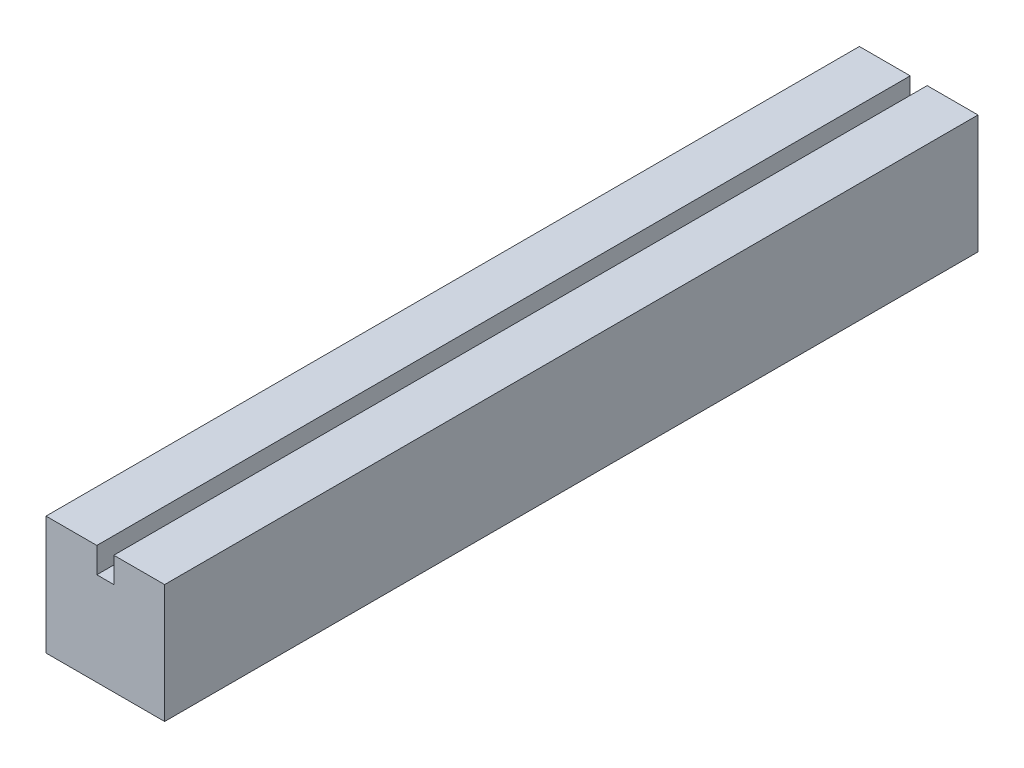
ISO-10303-21;
HEADER;
FILE_DESCRIPTION(('STEP AP214'),'2;1');
FILE_NAME('part.step','',(''),(''),'','','');
FILE_SCHEMA(('AUTOMOTIVE_DESIGN { 1 0 10303 214 1 1 1 1 }'));
ENDSEC;
DATA;
#1=APPLICATION_CONTEXT('core data for automotive mechanical design processes');
#2=APPLICATION_PROTOCOL_DEFINITION('international standard','automotive_design',2000,#1);
#3=PRODUCT_CONTEXT('',#1,'mechanical');
#4=PRODUCT('Part','Part','',(#3));
#5=PRODUCT_RELATED_PRODUCT_CATEGORY('part','',(#4));
#6=PRODUCT_DEFINITION_FORMATION('','',#4);
#7=PRODUCT_DEFINITION_CONTEXT('part definition',#1,'design');
#8=PRODUCT_DEFINITION('design','',#6,#7);
#9=PRODUCT_DEFINITION_SHAPE('','',#8);
#10=(LENGTH_UNIT() NAMED_UNIT(*) SI_UNIT(.MILLI.,.METRE.));
#11=(NAMED_UNIT(*) PLANE_ANGLE_UNIT() SI_UNIT($,.RADIAN.));
#12=(NAMED_UNIT(*) SI_UNIT($,.STERADIAN.) SOLID_ANGLE_UNIT());
#13=UNCERTAINTY_MEASURE_WITH_UNIT(LENGTH_MEASURE(1.E-05),#10,'distance_accuracy_value','');
#14=(GEOMETRIC_REPRESENTATION_CONTEXT(3) GLOBAL_UNCERTAINTY_ASSIGNED_CONTEXT((#13)) GLOBAL_UNIT_ASSIGNED_CONTEXT((#10,
#11,#12)) REPRESENTATION_CONTEXT('',''));
#15=CARTESIAN_POINT('',(0.,0.,0.));
#16=DIRECTION('',(0.,0.,1.));
#17=DIRECTION('',(1.,0.,0.));
#18=AXIS2_PLACEMENT_3D('',#15,#16,#17);
#19=CARTESIAN_POINT('',(0.,44.45,609.6));
#20=DIRECTION('',(0.,1.,0.));
#21=DIRECTION('',(0.,0.,1.));
#22=AXIS2_PLACEMENT_3D('',#19,#20,#21);
#23=PLANE('',#22);
#24=DIRECTION('',(1.,0.,0.));
#25=VECTOR('',#24,1.);
#26=CARTESIAN_POINT('',(0.,44.45,0.));
#27=LINE('',#26,#25);
#28=CARTESIAN_POINT('',(6.34999999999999,44.45,0.));
#29=VERTEX_POINT('',#28);
#30=CARTESIAN_POINT('',(44.45,44.45,0.));
#31=VERTEX_POINT('',#30);
#32=EDGE_CURVE('E139',#29,#31,#27,.T.);
#33=ORIENTED_EDGE('',*,*,#32,.F.);
#34=DIRECTION('',(0.,0.,-1.));
#35=VECTOR('',#34,1.);
#36=CARTESIAN_POINT('',(6.34999999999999,44.45,609.6));
#37=LINE('',#36,#35);
#38=CARTESIAN_POINT('',(6.34999999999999,44.45,609.6));
#39=VERTEX_POINT('',#38);
#40=EDGE_CURVE('E11',#39,#29,#37,.T.);
#41=ORIENTED_EDGE('',*,*,#40,.F.);
#42=DIRECTION('',(1.,0.,0.));
#43=VECTOR('',#42,1.);
#44=CARTESIAN_POINT('',(0.,44.45,609.6));
#45=LINE('',#44,#43);
#46=CARTESIAN_POINT('',(44.45,44.45,609.6));
#47=VERTEX_POINT('',#46);
#48=EDGE_CURVE('E164',#39,#47,#45,.T.);
#49=ORIENTED_EDGE('',*,*,#48,.T.);
#50=DIRECTION('',(0.,0.,-1.));
#51=VECTOR('',#50,1.);
#52=CARTESIAN_POINT('',(44.45,44.45,609.6));
#53=LINE('',#52,#51);
#54=EDGE_CURVE('E57',#47,#31,#53,.T.);
#55=ORIENTED_EDGE('',*,*,#54,.T.);
#56=EDGE_LOOP('',(#33,#41,#49,#55));
#57=FACE_BOUND('',#56,.T.);
#58=ADVANCED_FACE('F39',(#57),#23,.T.);
#59=CARTESIAN_POINT('',(6.35,0.,609.6));
#60=DIRECTION('',(1.,0.,0.));
#61=DIRECTION('',(0.,1.,0.));
#62=AXIS2_PLACEMENT_3D('',#59,#60,#61);
#63=PLANE('',#62);
#64=DIRECTION('',(0.,-1.,0.));
#65=VECTOR('',#64,1.);
#66=CARTESIAN_POINT('',(6.35,0.,0.));
#67=LINE('',#66,#65);
#68=CARTESIAN_POINT('',(6.34999999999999,25.4,0.));
#69=VERTEX_POINT('',#68);
#70=EDGE_CURVE('E142',#29,#69,#67,.T.);
#71=ORIENTED_EDGE('',*,*,#70,.T.);
#72=DIRECTION('',(0.,0.,-1.));
#73=VECTOR('',#72,1.);
#74=CARTESIAN_POINT('',(6.34999999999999,25.4,609.6));
#75=LINE('',#74,#73);
#76=CARTESIAN_POINT('',(6.34999999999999,25.4,609.6));
#77=VERTEX_POINT('',#76);
#78=EDGE_CURVE('E49',#77,#69,#75,.T.);
#79=ORIENTED_EDGE('',*,*,#78,.F.);
#80=DIRECTION('',(0.,-1.,0.));
#81=VECTOR('',#80,1.);
#82=CARTESIAN_POINT('',(6.35,0.,609.6));
#83=LINE('',#82,#81);
#84=EDGE_CURVE('E195',#39,#77,#83,.T.);
#85=ORIENTED_EDGE('',*,*,#84,.F.);
#86=ORIENTED_EDGE('',*,*,#40,.T.);
#87=EDGE_LOOP('',(#71,#79,#85,#86));
#88=FACE_BOUND('',#87,.T.);
#89=ADVANCED_FACE('F41',(#88),#63,.F.);
#90=CARTESIAN_POINT('',(0.,25.4,609.6));
#91=DIRECTION('',(0.,1.,0.));
#92=DIRECTION('',(0.,0.,1.));
#93=AXIS2_PLACEMENT_3D('',#90,#91,#92);
#94=PLANE('',#93);
#95=DIRECTION('',(1.,0.,0.));
#96=VECTOR('',#95,1.);
#97=CARTESIAN_POINT('',(0.,25.4,0.));
#98=LINE('',#97,#96);
#99=CARTESIAN_POINT('',(-6.35000000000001,25.4,0.));
#100=VERTEX_POINT('',#99);
#101=EDGE_CURVE('E147',#100,#69,#98,.T.);
#102=ORIENTED_EDGE('',*,*,#101,.F.);
#103=DIRECTION('',(0.,0.,-1.));
#104=VECTOR('',#103,1.);
#105=CARTESIAN_POINT('',(-6.35000000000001,25.4,609.6));
#106=LINE('',#105,#104);
#107=CARTESIAN_POINT('',(-6.35000000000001,25.4,609.6));
#108=VERTEX_POINT('',#107);
#109=EDGE_CURVE('E174',#108,#100,#106,.T.);
#110=ORIENTED_EDGE('',*,*,#109,.F.);
#111=DIRECTION('',(1.,0.,0.));
#112=VECTOR('',#111,1.);
#113=CARTESIAN_POINT('',(0.,25.4,609.6));
#114=LINE('',#113,#112);
#115=EDGE_CURVE('E183',#108,#77,#114,.T.);
#116=ORIENTED_EDGE('',*,*,#115,.T.);
#117=ORIENTED_EDGE('',*,*,#78,.T.);
#118=EDGE_LOOP('',(#102,#110,#116,#117));
#119=FACE_BOUND('',#118,.T.);
#120=ADVANCED_FACE('F181',(#119),#94,.T.);
#121=CARTESIAN_POINT('',(-6.35,0.,609.6));
#122=DIRECTION('',(1.,0.,0.));
#123=DIRECTION('',(0.,1.,0.));
#124=AXIS2_PLACEMENT_3D('',#121,#122,#123);
#125=PLANE('',#124);
#126=DIRECTION('',(0.,-1.,0.));
#127=VECTOR('',#126,1.);
#128=CARTESIAN_POINT('',(-6.35,0.,0.));
#129=LINE('',#128,#127);
#130=CARTESIAN_POINT('',(-6.35000000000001,44.45,0.));
#131=VERTEX_POINT('',#130);
#132=EDGE_CURVE('E151',#131,#100,#129,.T.);
#133=ORIENTED_EDGE('',*,*,#132,.F.);
#134=DIRECTION('',(0.,0.,-1.));
#135=VECTOR('',#134,1.);
#136=CARTESIAN_POINT('',(-6.35000000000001,44.45,609.6));
#137=LINE('',#136,#135);
#138=CARTESIAN_POINT('',(-6.35000000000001,44.45,609.6));
#139=VERTEX_POINT('',#138);
#140=EDGE_CURVE('E171',#139,#131,#137,.T.);
#141=ORIENTED_EDGE('',*,*,#140,.F.);
#142=DIRECTION('',(0.,-1.,0.));
#143=VECTOR('',#142,1.);
#144=CARTESIAN_POINT('',(-6.35,0.,609.6));
#145=LINE('',#144,#143);
#146=EDGE_CURVE('E194',#139,#108,#145,.T.);
#147=ORIENTED_EDGE('',*,*,#146,.T.);
#148=ORIENTED_EDGE('',*,*,#109,.T.);
#149=EDGE_LOOP('',(#133,#141,#147,#148));
#150=FACE_BOUND('',#149,.T.);
#151=ADVANCED_FACE('F192',(#150),#125,.T.);
#152=CARTESIAN_POINT('',(-44.45,44.45,0.));
#153=VERTEX_POINT('',#152);
#154=EDGE_CURVE('E143',#153,#131,#27,.T.);
#155=ORIENTED_EDGE('',*,*,#154,.F.);
#156=DIRECTION('',(0.,0.,-1.));
#157=VECTOR('',#156,1.);
#158=CARTESIAN_POINT('',(-44.45,44.45,609.6));
#159=LINE('',#158,#157);
#160=CARTESIAN_POINT('',(-44.45,44.45,609.6));
#161=VERTEX_POINT('',#160);
#162=EDGE_CURVE('E129',#161,#153,#159,.T.);
#163=ORIENTED_EDGE('',*,*,#162,.F.);
#164=EDGE_CURVE('E117',#161,#139,#45,.T.);
#165=ORIENTED_EDGE('',*,*,#164,.T.);
#166=ORIENTED_EDGE('',*,*,#140,.T.);
#167=EDGE_LOOP('',(#155,#163,#165,#166));
#168=FACE_BOUND('',#167,.T.);
#169=ADVANCED_FACE('F205',(#168),#23,.T.);
#170=CARTESIAN_POINT('',(-44.45,0.,609.6));
#171=DIRECTION('',(1.,0.,0.));
#172=DIRECTION('',(0.,1.,0.));
#173=AXIS2_PLACEMENT_3D('',#170,#171,#172);
#174=PLANE('',#173);
#175=DIRECTION('',(0.,-1.,0.));
#176=VECTOR('',#175,1.);
#177=CARTESIAN_POINT('',(-44.45,0.,0.));
#178=LINE('',#177,#176);
#179=CARTESIAN_POINT('',(-44.45,-44.45,0.));
#180=VERTEX_POINT('',#179);
#181=EDGE_CURVE('E125',#153,#180,#178,.T.);
#182=ORIENTED_EDGE('',*,*,#181,.T.);
#183=DIRECTION('',(0.,0.,-1.));
#184=VECTOR('',#183,1.);
#185=CARTESIAN_POINT('',(-44.45,-44.45,609.6));
#186=LINE('',#185,#184);
#187=CARTESIAN_POINT('',(-44.45,-44.45,609.6));
#188=VERTEX_POINT('',#187);
#189=EDGE_CURVE('E122',#188,#180,#186,.T.);
#190=ORIENTED_EDGE('',*,*,#189,.F.);
#191=DIRECTION('',(0.,-1.,0.));
#192=VECTOR('',#191,1.);
#193=CARTESIAN_POINT('',(-44.45,0.,609.6));
#194=LINE('',#193,#192);
#195=EDGE_CURVE('E108',#161,#188,#194,.T.);
#196=ORIENTED_EDGE('',*,*,#195,.F.);
#197=ORIENTED_EDGE('',*,*,#162,.T.);
#198=EDGE_LOOP('',(#182,#190,#196,#197));
#199=FACE_BOUND('',#198,.T.);
#200=ADVANCED_FACE('F123',(#199),#174,.F.);
#201=CARTESIAN_POINT('',(0.,-44.45,609.6));
#202=DIRECTION('',(0.,1.,0.));
#203=DIRECTION('',(0.,0.,1.));
#204=AXIS2_PLACEMENT_3D('',#201,#202,#203);
#205=PLANE('',#204);
#206=DIRECTION('',(1.,0.,0.));
#207=VECTOR('',#206,1.);
#208=CARTESIAN_POINT('',(0.,-44.45,0.));
#209=LINE('',#208,#207);
#210=CARTESIAN_POINT('',(44.45,-44.45,0.));
#211=VERTEX_POINT('',#210);
#212=EDGE_CURVE('E157',#180,#211,#209,.T.);
#213=ORIENTED_EDGE('',*,*,#212,.T.);
#214=DIRECTION('',(0.,0.,-1.));
#215=VECTOR('',#214,1.);
#216=CARTESIAN_POINT('',(44.45,-44.45,609.6));
#217=LINE('',#216,#215);
#218=CARTESIAN_POINT('',(44.45,-44.45,609.6));
#219=VERTEX_POINT('',#218);
#220=EDGE_CURVE('E83',#219,#211,#217,.T.);
#221=ORIENTED_EDGE('',*,*,#220,.F.);
#222=DIRECTION('',(1.,0.,0.));
#223=VECTOR('',#222,1.);
#224=CARTESIAN_POINT('',(0.,-44.45,609.6));
#225=LINE('',#224,#223);
#226=EDGE_CURVE('E114',#188,#219,#225,.T.);
#227=ORIENTED_EDGE('',*,*,#226,.F.);
#228=ORIENTED_EDGE('',*,*,#189,.T.);
#229=EDGE_LOOP('',(#213,#221,#227,#228));
#230=FACE_BOUND('',#229,.T.);
#231=ADVANCED_FACE('F131',(#230),#205,.F.);
#232=CARTESIAN_POINT('',(44.45,0.,609.6));
#233=DIRECTION('',(1.,0.,0.));
#234=DIRECTION('',(0.,1.,0.));
#235=AXIS2_PLACEMENT_3D('',#232,#233,#234);
#236=PLANE('',#235);
#237=DIRECTION('',(0.,-1.,0.));
#238=VECTOR('',#237,1.);
#239=CARTESIAN_POINT('',(44.45,0.,0.));
#240=LINE('',#239,#238);
#241=EDGE_CURVE('E160',#31,#211,#240,.T.);
#242=ORIENTED_EDGE('',*,*,#241,.F.);
#243=ORIENTED_EDGE('',*,*,#54,.F.);
#244=DIRECTION('',(0.,-1.,0.));
#245=VECTOR('',#244,1.);
#246=CARTESIAN_POINT('',(44.45,0.,609.6));
#247=LINE('',#246,#245);
#248=EDGE_CURVE('E133',#47,#219,#247,.T.);
#249=ORIENTED_EDGE('',*,*,#248,.T.);
#250=ORIENTED_EDGE('',*,*,#220,.T.);
#251=EDGE_LOOP('',(#242,#243,#249,#250));
#252=FACE_BOUND('',#251,.T.);
#253=ADVANCED_FACE('F206',(#252),#236,.T.);
#254=CARTESIAN_POINT('',(0.,0.,609.6));
#255=DIRECTION('',(0.,0.,1.));
#256=DIRECTION('',(1.,0.,0.));
#257=AXIS2_PLACEMENT_3D('',#254,#255,#256);
#258=PLANE('',#257);
#259=ORIENTED_EDGE('',*,*,#48,.F.);
#260=ORIENTED_EDGE('',*,*,#84,.T.);
#261=ORIENTED_EDGE('',*,*,#115,.F.);
#262=ORIENTED_EDGE('',*,*,#146,.F.);
#263=ORIENTED_EDGE('',*,*,#164,.F.);
#264=ORIENTED_EDGE('',*,*,#195,.T.);
#265=ORIENTED_EDGE('',*,*,#226,.T.);
#266=ORIENTED_EDGE('',*,*,#248,.F.);
#267=EDGE_LOOP('',(#259,#260,#261,#262,#263,#264,#265,#266));
#268=FACE_BOUND('',#267,.T.);
#269=ADVANCED_FACE('F111',(#268),#258,.T.);
#270=CARTESIAN_POINT('',(0.,0.,0.));
#271=DIRECTION('',(0.,0.,1.));
#272=DIRECTION('',(1.,0.,0.));
#273=AXIS2_PLACEMENT_3D('',#270,#271,#272);
#274=PLANE('',#273);
#275=ORIENTED_EDGE('',*,*,#32,.T.);
#276=ORIENTED_EDGE('',*,*,#241,.T.);
#277=ORIENTED_EDGE('',*,*,#212,.F.);
#278=ORIENTED_EDGE('',*,*,#181,.F.);
#279=ORIENTED_EDGE('',*,*,#154,.T.);
#280=ORIENTED_EDGE('',*,*,#132,.T.);
#281=ORIENTED_EDGE('',*,*,#101,.T.);
#282=ORIENTED_EDGE('',*,*,#70,.F.);
#283=EDGE_LOOP('',(#275,#276,#277,#278,#279,#280,#281,#282));
#284=FACE_BOUND('',#283,.T.);
#285=ADVANCED_FACE('F187',(#284),#274,.F.);
#286=CLOSED_SHELL('',(#58,#89,#120,#151,#169,#200,#231,#253,#269,#285));
#287=MANIFOLD_SOLID_BREP('B2',#286);
#288=ADVANCED_BREP_SHAPE_REPRESENTATION('',(#18,#287),#14);
#289=SHAPE_DEFINITION_REPRESENTATION(#9,#288);
ENDSEC;
END-ISO-10303-21;
